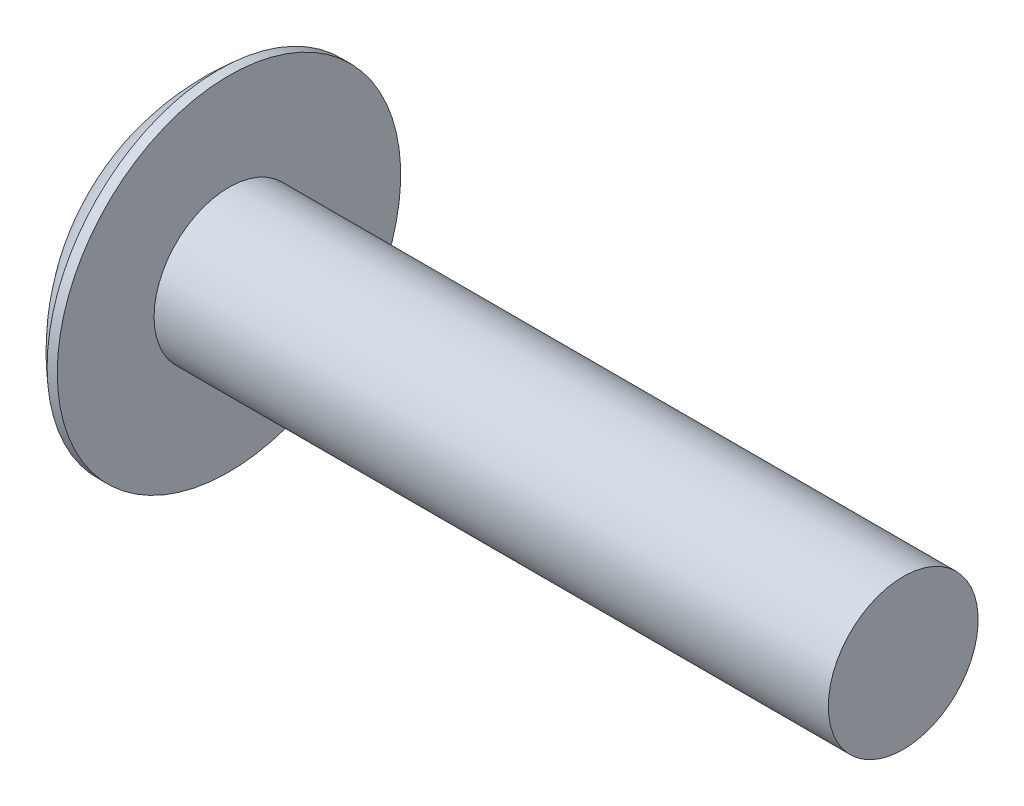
ISO-10303-21;
HEADER;
FILE_DESCRIPTION(('STEP AP214'),'2;1');
FILE_NAME('part.step','',(''),(''),'','','');
FILE_SCHEMA(('AUTOMOTIVE_DESIGN { 1 0 10303 214 1 1 1 1 }'));
ENDSEC;
DATA;
#1=APPLICATION_CONTEXT('core data for automotive mechanical design processes');
#2=APPLICATION_PROTOCOL_DEFINITION('international standard','automotive_design',2000,#1);
#3=PRODUCT_CONTEXT('',#1,'mechanical');
#4=PRODUCT('Part','Part','',(#3));
#5=PRODUCT_RELATED_PRODUCT_CATEGORY('part','',(#4));
#6=PRODUCT_DEFINITION_FORMATION('','',#4);
#7=PRODUCT_DEFINITION_CONTEXT('part definition',#1,'design');
#8=PRODUCT_DEFINITION('design','',#6,#7);
#9=PRODUCT_DEFINITION_SHAPE('','',#8);
#10=(LENGTH_UNIT() NAMED_UNIT(*) SI_UNIT(.MILLI.,.METRE.));
#11=(NAMED_UNIT(*) PLANE_ANGLE_UNIT() SI_UNIT($,.RADIAN.));
#12=(NAMED_UNIT(*) SI_UNIT($,.STERADIAN.) SOLID_ANGLE_UNIT());
#13=UNCERTAINTY_MEASURE_WITH_UNIT(LENGTH_MEASURE(1.E-05),#10,'distance_accuracy_value','');
#14=(GEOMETRIC_REPRESENTATION_CONTEXT(3) GLOBAL_UNCERTAINTY_ASSIGNED_CONTEXT((#13)) GLOBAL_UNIT_ASSIGNED_CONTEXT((#10,
#11,#12)) REPRESENTATION_CONTEXT('',''));
#15=CARTESIAN_POINT('',(0.,0.,0.));
#16=DIRECTION('',(0.,0.,1.));
#17=DIRECTION('',(1.,0.,0.));
#18=AXIS2_PLACEMENT_3D('',#15,#16,#17);
#19=CARTESIAN_POINT('',(9.525,0.,0.));
#20=DIRECTION('',(-1.,0.,0.));
#21=DIRECTION('',(0.,1.,0.));
#22=AXIS2_PLACEMENT_3D('',#19,#20,#21);
#23=SPHERICAL_SURFACE('',#22,9.525);
#24=CARTESIAN_POINT('',(3.37931528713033,0.,0.));
#25=DIRECTION('',(-1.,0.,0.));
#26=DIRECTION('',(0.,0.,1.));
#27=AXIS2_PLACEMENT_3D('',#24,#25,#26);
#28=CIRCLE('',#27,7.2771);
#29=CARTESIAN_POINT('',(3.37931528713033,0.,7.2771));
#30=VERTEX_POINT('',#29);
#31=EDGE_CURVE('E152',#30,#30,#28,.T.);
#32=ORIENTED_EDGE('',*,*,#31,.T.);
#33=EDGE_LOOP('',(#32));
#34=FACE_BOUND('',#33,.T.);
#35=CARTESIAN_POINT('',(9.52329760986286,-0.0217428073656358,0.));
#36=DIRECTION('',(-0.0780578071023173,-0.996948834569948,0.));
#37=DIRECTION('',(0.996948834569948,-0.0780578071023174,0.));
#38=AXIS2_PLACEMENT_3D('',#35,#36,#37);
#39=CIRCLE('',#38,9.5249750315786);
#40=CARTESIAN_POINT('',(0.697961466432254,0.669251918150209,3.51583810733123));
#41=VERTEX_POINT('',#40);
#42=CARTESIAN_POINT('',(0.0545254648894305,0.719630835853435,0.719630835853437));
#43=VERTEX_POINT('',#42);
#44=EDGE_CURVE('E180',#41,#43,#39,.T.);
#45=ORIENTED_EDGE('',*,*,#44,.F.);
#46=CARTESIAN_POINT('',(7.77827630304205,0.,-2.17370060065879));
#47=DIRECTION('',(0.626391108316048,0.,0.779508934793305));
#48=DIRECTION('',(0.779508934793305,0.,-0.626391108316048));
#49=AXIS2_PLACEMENT_3D('',#46,#47,#48);
#50=CIRCLE('',#49,9.10766748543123);
#51=CARTESIAN_POINT('',(0.697961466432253,-0.669251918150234,3.51583810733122));
#52=VERTEX_POINT('',#51);
#53=EDGE_CURVE('E148',#41,#52,#50,.T.);
#54=ORIENTED_EDGE('',*,*,#53,.T.);
#55=CARTESIAN_POINT('',(9.52329760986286,0.0217428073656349,0.));
#56=DIRECTION('',(-0.0780578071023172,0.996948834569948,0.));
#57=DIRECTION('',(-0.996948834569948,-0.0780578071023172,0.));
#58=AXIS2_PLACEMENT_3D('',#55,#56,#57);
#59=CIRCLE('',#58,9.5249750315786);
#60=CARTESIAN_POINT('',(0.0545254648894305,-0.719630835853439,0.719630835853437));
#61=VERTEX_POINT('',#60);
#62=EDGE_CURVE('E104',#61,#52,#59,.T.);
#63=ORIENTED_EDGE('',*,*,#62,.F.);
#64=CARTESIAN_POINT('',(9.52329760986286,0.,-0.0217428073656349));
#65=DIRECTION('',(-0.0780578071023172,0.,-0.996948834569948));
#66=DIRECTION('',(-0.996948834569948,0.,0.0780578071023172));
#67=AXIS2_PLACEMENT_3D('',#64,#65,#66);
#68=CIRCLE('',#67,9.5249750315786);
#69=CARTESIAN_POINT('',(0.697961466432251,-3.51583810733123,0.669251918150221));
#70=VERTEX_POINT('',#69);
#71=EDGE_CURVE('E129',#70,#61,#68,.T.);
#72=ORIENTED_EDGE('',*,*,#71,.F.);
#73=CARTESIAN_POINT('',(7.77827630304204,2.17370060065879,0.));
#74=DIRECTION('',(0.626391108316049,-0.779508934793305,0.));
#75=DIRECTION('',(0.779508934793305,0.626391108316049,0.));
#76=AXIS2_PLACEMENT_3D('',#73,#74,#75);
#77=CIRCLE('',#76,9.10766748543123);
#78=CARTESIAN_POINT('',(0.697961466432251,-3.51583810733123,-0.669251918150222));
#79=VERTEX_POINT('',#78);
#80=EDGE_CURVE('E137',#70,#79,#77,.T.);
#81=ORIENTED_EDGE('',*,*,#80,.T.);
#82=CARTESIAN_POINT('',(9.52329760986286,0.,0.0217428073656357));
#83=DIRECTION('',(-0.0780578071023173,0.,0.996948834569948));
#84=DIRECTION('',(0.996948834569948,0.,0.0780578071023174));
#85=AXIS2_PLACEMENT_3D('',#82,#83,#84);
#86=CIRCLE('',#85,9.5249750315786);
#87=CARTESIAN_POINT('',(0.0545254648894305,-0.719630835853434,-0.719630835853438));
#88=VERTEX_POINT('',#87);
#89=EDGE_CURVE('E47',#88,#79,#86,.T.);
#90=ORIENTED_EDGE('',*,*,#89,.F.);
#91=CARTESIAN_POINT('',(0.697961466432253,-0.669251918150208,-3.51583810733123));
#92=VERTEX_POINT('',#91);
#93=EDGE_CURVE('E187',#92,#88,#59,.T.);
#94=ORIENTED_EDGE('',*,*,#93,.F.);
#95=CARTESIAN_POINT('',(7.77827630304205,0.,2.17370060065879));
#96=DIRECTION('',(0.626391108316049,0.,-0.779508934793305));
#97=DIRECTION('',(-0.779508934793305,0.,-0.626391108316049));
#98=AXIS2_PLACEMENT_3D('',#95,#96,#97);
#99=CIRCLE('',#98,9.10766748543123);
#100=CARTESIAN_POINT('',(0.697961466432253,0.669251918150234,-3.51583810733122));
#101=VERTEX_POINT('',#100);
#102=EDGE_CURVE('E130',#92,#101,#99,.T.);
#103=ORIENTED_EDGE('',*,*,#102,.T.);
#104=CARTESIAN_POINT('',(0.0545254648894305,0.71963083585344,-0.719630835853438));
#105=VERTEX_POINT('',#104);
#106=EDGE_CURVE('E175',#105,#101,#39,.T.);
#107=ORIENTED_EDGE('',*,*,#106,.F.);
#108=CARTESIAN_POINT('',(0.697961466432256,3.51583810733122,-0.669251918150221));
#109=VERTEX_POINT('',#108);
#110=EDGE_CURVE('E40',#109,#105,#86,.T.);
#111=ORIENTED_EDGE('',*,*,#110,.F.);
#112=CARTESIAN_POINT('',(7.77827630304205,-2.17370060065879,0.));
#113=DIRECTION('',(0.626391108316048,0.779508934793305,0.));
#114=DIRECTION('',(-0.779508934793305,0.626391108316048,0.));
#115=AXIS2_PLACEMENT_3D('',#112,#113,#114);
#116=CIRCLE('',#115,9.10766748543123);
#117=CARTESIAN_POINT('',(0.697961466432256,3.51583810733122,0.669251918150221));
#118=VERTEX_POINT('',#117);
#119=EDGE_CURVE('E11',#109,#118,#116,.T.);
#120=ORIENTED_EDGE('',*,*,#119,.T.);
#121=EDGE_CURVE('E163',#43,#118,#68,.T.);
#122=ORIENTED_EDGE('',*,*,#121,.F.);
#123=EDGE_LOOP('',(#45,#54,#63,#72,#81,#90,#94,#103,#107,#111,#120,#122));
#124=FACE_BOUND('',#123,.T.);
#125=ADVANCED_FACE('F32',(#34,#124),#23,.T.);
#126=CARTESIAN_POINT('',(5.07322666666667,0.,-0.326683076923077));
#127=DIRECTION('',(-0.0780578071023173,0.,0.996948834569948));
#128=DIRECTION('',(0.996948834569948,0.,0.0780578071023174));
#129=AXIS2_PLACEMENT_3D('',#126,#127,#128);
#130=PLANE('',#129);
#131=ORIENTED_EDGE('',*,*,#110,.T.);
#132=DIRECTION('',(0.993925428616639,-0.0778210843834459,0.0778210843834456));
#133=VECTOR('',#132,1.);
#134=CARTESIAN_POINT('',(5.09849506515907,0.324704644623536,-0.324704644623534));
#135=LINE('',#134,#133);
#136=CARTESIAN_POINT('',(4.6228,0.361950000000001,-0.361949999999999));
#137=VERTEX_POINT('',#136);
#138=EDGE_CURVE('E169',#105,#137,#135,.T.);
#139=ORIENTED_EDGE('',*,*,#138,.T.);
#140=DIRECTION('',(0.778061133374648,-0.62522769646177,0.0609196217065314));
#141=VECTOR('',#140,1.);
#142=CARTESIAN_POINT('',(0.,4.0767,-0.7239));
#143=LINE('',#142,#141);
#144=EDGE_CURVE('E153',#109,#137,#143,.T.);
#145=ORIENTED_EDGE('',*,*,#144,.F.);
#146=EDGE_LOOP('',(#131,#139,#145));
#147=FACE_BOUND('',#146,.T.);
#148=ADVANCED_FACE('F168',(#147),#130,.T.);
#149=DIRECTION('',(0.778061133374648,0.625227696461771,0.0609196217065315));
#150=VECTOR('',#149,1.);
#151=CARTESIAN_POINT('',(0.,-4.0767,-0.7239));
#152=LINE('',#151,#150);
#153=CARTESIAN_POINT('',(4.6228,-0.36195,-0.36195));
#154=VERTEX_POINT('',#153);
#155=EDGE_CURVE('E138',#79,#154,#152,.T.);
#156=ORIENTED_EDGE('',*,*,#155,.T.);
#157=DIRECTION('',(-0.993925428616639,-0.0778210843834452,-0.0778210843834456));
#158=VECTOR('',#157,1.);
#159=CARTESIAN_POINT('',(5.09849506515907,-0.324704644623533,-0.324704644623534));
#160=LINE('',#159,#158);
#161=EDGE_CURVE('E190',#154,#88,#160,.T.);
#162=ORIENTED_EDGE('',*,*,#161,.T.);
#163=ORIENTED_EDGE('',*,*,#89,.T.);
#164=EDGE_LOOP('',(#156,#162,#163));
#165=FACE_BOUND('',#164,.T.);
#166=ADVANCED_FACE('F205',(#165),#130,.T.);
#167=CARTESIAN_POINT('',(5.07322666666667,0.,0.326683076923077));
#168=DIRECTION('',(-0.0780578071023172,0.,-0.996948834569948));
#169=DIRECTION('',(-0.996948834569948,0.,0.0780578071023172));
#170=AXIS2_PLACEMENT_3D('',#167,#168,#169);
#171=PLANE('',#170);
#172=DIRECTION('',(0.778061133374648,-0.62522769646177,-0.0609196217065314));
#173=VECTOR('',#172,1.);
#174=CARTESIAN_POINT('',(0.,4.0767,0.7239));
#175=LINE('',#174,#173);
#176=CARTESIAN_POINT('',(4.6228,0.36195,0.36195));
#177=VERTEX_POINT('',#176);
#178=EDGE_CURVE('E206',#118,#177,#175,.T.);
#179=ORIENTED_EDGE('',*,*,#178,.T.);
#180=DIRECTION('',(-0.993925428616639,0.0778210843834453,0.0778210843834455));
#181=VECTOR('',#180,1.);
#182=CARTESIAN_POINT('',(5.09849506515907,0.324704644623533,0.324704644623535));
#183=LINE('',#182,#181);
#184=EDGE_CURVE('E184',#177,#43,#183,.T.);
#185=ORIENTED_EDGE('',*,*,#184,.T.);
#186=ORIENTED_EDGE('',*,*,#121,.T.);
#187=EDGE_LOOP('',(#179,#185,#186));
#188=FACE_BOUND('',#187,.T.);
#189=ADVANCED_FACE('F210',(#188),#171,.T.);
#190=ORIENTED_EDGE('',*,*,#71,.T.);
#191=DIRECTION('',(0.993925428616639,0.0778210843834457,-0.0778210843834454));
#192=VECTOR('',#191,1.);
#193=CARTESIAN_POINT('',(5.09849506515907,-0.324704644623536,0.324704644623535));
#194=LINE('',#193,#192);
#195=CARTESIAN_POINT('',(4.6228,-0.361950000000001,0.361949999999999));
#196=VERTEX_POINT('',#195);
#197=EDGE_CURVE('E102',#61,#196,#194,.T.);
#198=ORIENTED_EDGE('',*,*,#197,.T.);
#199=DIRECTION('',(0.778061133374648,0.625227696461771,-0.0609196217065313));
#200=VECTOR('',#199,1.);
#201=CARTESIAN_POINT('',(0.,-4.0767,0.723899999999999));
#202=LINE('',#201,#200);
#203=EDGE_CURVE('E127',#70,#196,#202,.T.);
#204=ORIENTED_EDGE('',*,*,#203,.F.);
#205=EDGE_LOOP('',(#190,#198,#204));
#206=FACE_BOUND('',#205,.T.);
#207=ADVANCED_FACE('F126',(#206),#171,.T.);
#208=CARTESIAN_POINT('',(-25.4,0.,0.));
#209=DIRECTION('',(-1.,0.,0.));
#210=DIRECTION('',(0.,0.,1.));
#211=AXIS2_PLACEMENT_3D('',#208,#209,#210);
#212=CYLINDRICAL_SURFACE('',#211,3.175);
#213=CARTESIAN_POINT('',(32.385,0.,0.));
#214=DIRECTION('',(-1.,0.,0.));
#215=DIRECTION('',(0.,0.,1.));
#216=AXIS2_PLACEMENT_3D('',#213,#214,#215);
#217=CIRCLE('',#216,3.175);
#218=CARTESIAN_POINT('',(32.385,0.,3.175));
#219=VERTEX_POINT('',#218);
#220=EDGE_CURVE('E149',#219,#219,#217,.T.);
#221=ORIENTED_EDGE('',*,*,#220,.T.);
#222=EDGE_LOOP('',(#221));
#223=FACE_BOUND('',#222,.T.);
#224=CARTESIAN_POINT('',(3.81,0.,0.));
#225=DIRECTION('',(-1.,0.,0.));
#226=DIRECTION('',(0.,0.,1.));
#227=AXIS2_PLACEMENT_3D('',#224,#225,#226);
#228=CIRCLE('',#227,3.175);
#229=CARTESIAN_POINT('',(3.81,0.,3.175));
#230=VERTEX_POINT('',#229);
#231=EDGE_CURVE('E159',#230,#230,#228,.T.);
#232=ORIENTED_EDGE('',*,*,#231,.F.);
#233=EDGE_LOOP('',(#232));
#234=FACE_BOUND('',#233,.T.);
#235=ADVANCED_FACE('F34',(#223,#234),#212,.T.);
#236=CARTESIAN_POINT('',(3.81,3.175,0.));
#237=DIRECTION('',(-1.,0.,0.));
#238=DIRECTION('',(0.,0.,1.));
#239=AXIS2_PLACEMENT_3D('',#236,#237,#238);
#240=PLANE('',#239);
#241=CARTESIAN_POINT('',(3.81,0.,0.));
#242=DIRECTION('',(-1.,0.,0.));
#243=DIRECTION('',(0.,0.,1.));
#244=AXIS2_PLACEMENT_3D('',#241,#242,#243);
#245=CIRCLE('',#244,7.2771);
#246=CARTESIAN_POINT('',(3.81,0.,7.2771));
#247=VERTEX_POINT('',#246);
#248=EDGE_CURVE('E156',#247,#247,#245,.T.);
#249=ORIENTED_EDGE('',*,*,#248,.F.);
#250=EDGE_LOOP('',(#249));
#251=FACE_BOUND('',#250,.T.);
#252=ORIENTED_EDGE('',*,*,#231,.T.);
#253=EDGE_LOOP('',(#252));
#254=FACE_BOUND('',#253,.T.);
#255=ADVANCED_FACE('F234',(#251,#254),#240,.F.);
#256=CARTESIAN_POINT('',(-25.4,0.,0.));
#257=DIRECTION('',(-1.,0.,0.));
#258=DIRECTION('',(0.,0.,1.));
#259=AXIS2_PLACEMENT_3D('',#256,#257,#258);
#260=CYLINDRICAL_SURFACE('',#259,7.2771);
#261=ORIENTED_EDGE('',*,*,#248,.T.);
#262=EDGE_LOOP('',(#261));
#263=FACE_BOUND('',#262,.T.);
#264=ORIENTED_EDGE('',*,*,#31,.F.);
#265=EDGE_LOOP('',(#264));
#266=FACE_BOUND('',#265,.T.);
#267=ADVANCED_FACE('F232',(#263,#266),#260,.T.);
#268=CARTESIAN_POINT('',(32.385,3.175,0.));
#269=DIRECTION('',(1.,0.,0.));
#270=DIRECTION('',(0.,0.,-1.));
#271=AXIS2_PLACEMENT_3D('',#268,#269,#270);
#272=PLANE('',#271);
#273=ORIENTED_EDGE('',*,*,#220,.F.);
#274=EDGE_LOOP('',(#273));
#275=FACE_BOUND('',#274,.T.);
#276=ADVANCED_FACE('F230',(#275),#272,.T.);
#277=CARTESIAN_POINT('',(4.6228,0.36195,0.36195));
#278=DIRECTION('',(0.626391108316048,0.779508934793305,0.));
#279=DIRECTION('',(-0.779508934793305,0.626391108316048,0.));
#280=AXIS2_PLACEMENT_3D('',#277,#278,#279);
#281=PLANE('',#280);
#282=ORIENTED_EDGE('',*,*,#144,.T.);
#283=DIRECTION('',(0.,0.,-1.));
#284=VECTOR('',#283,1.);
#285=CARTESIAN_POINT('',(4.6228,0.36195,0.36195));
#286=LINE('',#285,#284);
#287=EDGE_CURVE('E120',#177,#137,#286,.T.);
#288=ORIENTED_EDGE('',*,*,#287,.F.);
#289=ORIENTED_EDGE('',*,*,#178,.F.);
#290=ORIENTED_EDGE('',*,*,#119,.F.);
#291=EDGE_LOOP('',(#282,#288,#289,#290));
#292=FACE_BOUND('',#291,.T.);
#293=ADVANCED_FACE('F209',(#292),#281,.F.);
#294=CARTESIAN_POINT('',(4.6228,-0.36195,-0.36195));
#295=DIRECTION('',(0.626391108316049,-0.779508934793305,0.));
#296=DIRECTION('',(0.779508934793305,0.626391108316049,0.));
#297=AXIS2_PLACEMENT_3D('',#294,#295,#296);
#298=PLANE('',#297);
#299=ORIENTED_EDGE('',*,*,#203,.T.);
#300=DIRECTION('',(0.,0.,1.));
#301=VECTOR('',#300,1.);
#302=CARTESIAN_POINT('',(4.6228,-0.36195,-0.36195));
#303=LINE('',#302,#301);
#304=EDGE_CURVE('E119',#154,#196,#303,.T.);
#305=ORIENTED_EDGE('',*,*,#304,.F.);
#306=ORIENTED_EDGE('',*,*,#155,.F.);
#307=ORIENTED_EDGE('',*,*,#80,.F.);
#308=EDGE_LOOP('',(#299,#305,#306,#307));
#309=FACE_BOUND('',#308,.T.);
#310=ADVANCED_FACE('F134',(#309),#298,.F.);
#311=CARTESIAN_POINT('',(4.6228,0.36195,-0.36195));
#312=DIRECTION('',(-1.,0.,0.));
#313=DIRECTION('',(0.,0.,1.));
#314=AXIS2_PLACEMENT_3D('',#311,#312,#313);
#315=PLANE('',#314);
#316=DIRECTION('',(0.,1.,0.));
#317=VECTOR('',#316,1.);
#318=CARTESIAN_POINT('',(4.6228,-0.36195,-0.36195));
#319=LINE('',#318,#317);
#320=EDGE_CURVE('E142',#154,#137,#319,.T.);
#321=ORIENTED_EDGE('',*,*,#320,.F.);
#322=ORIENTED_EDGE('',*,*,#304,.T.);
#323=DIRECTION('',(0.,-1.,0.));
#324=VECTOR('',#323,1.);
#325=CARTESIAN_POINT('',(4.6228,0.36195,0.36195));
#326=LINE('',#325,#324);
#327=EDGE_CURVE('E111',#177,#196,#326,.T.);
#328=ORIENTED_EDGE('',*,*,#327,.F.);
#329=ORIENTED_EDGE('',*,*,#287,.T.);
#330=EDGE_LOOP('',(#321,#322,#328,#329));
#331=FACE_BOUND('',#330,.T.);
#332=ADVANCED_FACE('F140',(#331),#315,.T.);
#333=CARTESIAN_POINT('',(4.6228,0.361950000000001,-0.361949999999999));
#334=DIRECTION('',(0.626391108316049,0.,-0.779508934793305));
#335=DIRECTION('',(0.779508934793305,0.,0.626391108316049));
#336=AXIS2_PLACEMENT_3D('',#333,#334,#335);
#337=PLANE('',#336);
#338=DIRECTION('',(0.778061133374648,0.0609196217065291,0.625227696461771));
#339=VECTOR('',#338,1.);
#340=CARTESIAN_POINT('',(0.,-0.723899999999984,-4.0767));
#341=LINE('',#340,#339);
#342=EDGE_CURVE('E195',#92,#154,#341,.T.);
#343=ORIENTED_EDGE('',*,*,#342,.T.);
#344=ORIENTED_EDGE('',*,*,#320,.T.);
#345=DIRECTION('',(0.778061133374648,-0.0609196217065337,0.62522769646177));
#346=VECTOR('',#345,1.);
#347=CARTESIAN_POINT('',(0.,0.723900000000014,-4.0767));
#348=LINE('',#347,#346);
#349=EDGE_CURVE('E108',#101,#137,#348,.T.);
#350=ORIENTED_EDGE('',*,*,#349,.F.);
#351=ORIENTED_EDGE('',*,*,#102,.F.);
#352=EDGE_LOOP('',(#343,#344,#350,#351));
#353=FACE_BOUND('',#352,.T.);
#354=ADVANCED_FACE('F200',(#353),#337,.F.);
#355=CARTESIAN_POINT('',(5.07322666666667,-0.326683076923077,0.));
#356=DIRECTION('',(-0.0780578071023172,0.996948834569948,0.));
#357=DIRECTION('',(-0.996948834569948,-0.0780578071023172,0.));
#358=AXIS2_PLACEMENT_3D('',#355,#356,#357);
#359=PLANE('',#358);
#360=ORIENTED_EDGE('',*,*,#93,.T.);
#361=ORIENTED_EDGE('',*,*,#161,.F.);
#362=ORIENTED_EDGE('',*,*,#342,.F.);
#363=EDGE_LOOP('',(#360,#361,#362));
#364=FACE_BOUND('',#363,.T.);
#365=ADVANCED_FACE('F204',(#364),#359,.T.);
#366=CARTESIAN_POINT('',(5.07322666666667,0.326683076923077,0.));
#367=DIRECTION('',(-0.0780578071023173,-0.996948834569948,0.));
#368=DIRECTION('',(0.996948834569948,-0.0780578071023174,0.));
#369=AXIS2_PLACEMENT_3D('',#366,#367,#368);
#370=PLANE('',#369);
#371=ORIENTED_EDGE('',*,*,#106,.T.);
#372=ORIENTED_EDGE('',*,*,#349,.T.);
#373=ORIENTED_EDGE('',*,*,#138,.F.);
#374=EDGE_LOOP('',(#371,#372,#373));
#375=FACE_BOUND('',#374,.T.);
#376=ADVANCED_FACE('F198',(#375),#370,.T.);
#377=CARTESIAN_POINT('',(4.6228,-0.361950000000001,0.361949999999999));
#378=DIRECTION('',(0.626391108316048,0.,0.779508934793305));
#379=DIRECTION('',(-0.779508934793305,0.,0.626391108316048));
#380=AXIS2_PLACEMENT_3D('',#377,#378,#379);
#381=PLANE('',#380);
#382=DIRECTION('',(0.778061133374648,-0.0609196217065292,-0.625227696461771));
#383=VECTOR('',#382,1.);
#384=CARTESIAN_POINT('',(0.,0.723899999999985,4.0767));
#385=LINE('',#384,#383);
#386=EDGE_CURVE('E107',#41,#177,#385,.T.);
#387=ORIENTED_EDGE('',*,*,#386,.T.);
#388=ORIENTED_EDGE('',*,*,#327,.T.);
#389=DIRECTION('',(0.778061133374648,0.0609196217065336,-0.62522769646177));
#390=VECTOR('',#389,1.);
#391=CARTESIAN_POINT('',(0.,-0.723900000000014,4.0767));
#392=LINE('',#391,#390);
#393=EDGE_CURVE('E98',#52,#196,#392,.T.);
#394=ORIENTED_EDGE('',*,*,#393,.F.);
#395=ORIENTED_EDGE('',*,*,#53,.F.);
#396=EDGE_LOOP('',(#387,#388,#394,#395));
#397=FACE_BOUND('',#396,.T.);
#398=ADVANCED_FACE('F112',(#397),#381,.F.);
#399=ORIENTED_EDGE('',*,*,#44,.T.);
#400=ORIENTED_EDGE('',*,*,#184,.F.);
#401=ORIENTED_EDGE('',*,*,#386,.F.);
#402=EDGE_LOOP('',(#399,#400,#401));
#403=FACE_BOUND('',#402,.T.);
#404=ADVANCED_FACE('F211',(#403),#370,.T.);
#405=ORIENTED_EDGE('',*,*,#62,.T.);
#406=ORIENTED_EDGE('',*,*,#393,.T.);
#407=ORIENTED_EDGE('',*,*,#197,.F.);
#408=EDGE_LOOP('',(#405,#406,#407));
#409=FACE_BOUND('',#408,.T.);
#410=ADVANCED_FACE('F100',(#409),#359,.T.);
#411=CLOSED_SHELL('',(#125,#148,#166,#189,#207,#235,#255,#267,#276,#293,#310,#332,#354,#365,
#376,#398,#404,#410));
#412=MANIFOLD_SOLID_BREP('B2',#411);
#413=ADVANCED_BREP_SHAPE_REPRESENTATION('',(#18,#412),#14);
#414=SHAPE_DEFINITION_REPRESENTATION(#9,#413);
ENDSEC;
END-ISO-10303-21;
